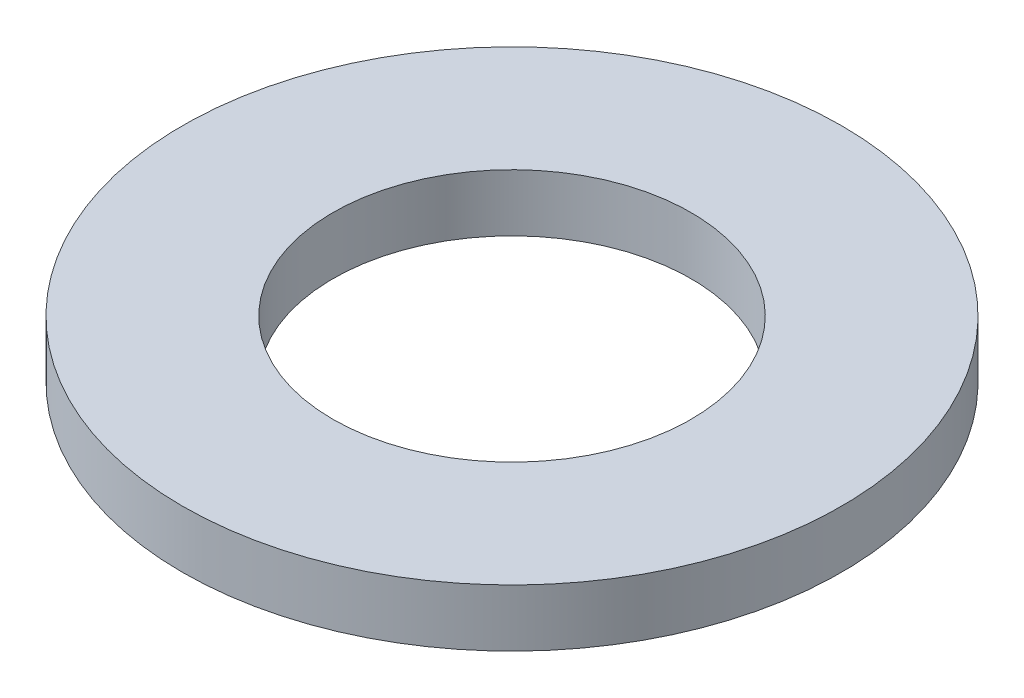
from build123d import *

# Parameters (mm, degrees)
SKETCH1_R      = 46
SKETCH1_R_2    = 25
EXTRUDE1_DEPTH = 8


with BuildPart() as part:
    # Sketch1 → Extrude1 (new body)
    with BuildSketch(Plane(origin=(0, 0, 0), x_dir=(1, 0, 0), z_dir=(0, 1, 0))):
        with Locations(Location((0, 0, 0), (0, 0, 270))):
            Circle(SKETCH1_R)
        with Locations(Location((0, 0, 0), (0, 0, 270))):
            Circle(SKETCH1_R_2, mode=Mode.SUBTRACT)
    extrude(amount=EXTRUDE1_DEPTH)


solid = part.part
